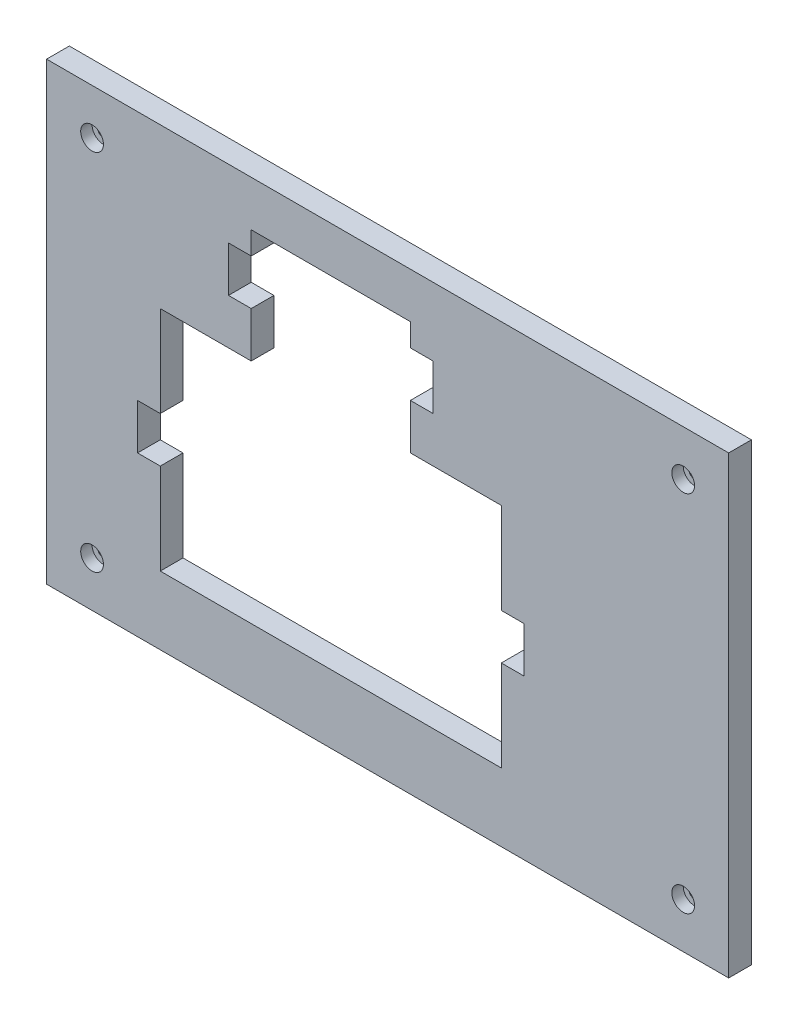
from build123d import *

# Parameters (mm, degrees)
ESQUISSE1_W                     = 300
ESQUISSE1_H                     = 200
EXTRUSION1_DEPTH                = 10
ENL_V_MAT_EXTRU_1_DEPTH         = 361.693775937
ESQUISSE4_R                     = 5
ENL_V_MAT_EXTRU_2_DEPTH         = 5
ESQUISSE5_R                     = 2.5
ENL_V_MAT_EXTRU_3_DEPTH         = 361.589794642
R_P_TITION_LIN_AIRE1_COUNT      = 2
R_P_TITION_LIN_AIRE1_PITCH      = 260
R_P_TITION_LIN_AIRE1_COUNT_DIR2 = 2
R_P_TITION_LIN_AIRE1_PITCH_DIR2 = 160


with BuildPart() as part:
    # Esquisse1 → Extrusion1 (new body)
    with BuildSketch(Plane.XY):
        with Locations((150, 100)):
            Rectangle(ESQUISSE1_W, ESQUISSE1_H)
    extrude(amount=-EXTRUSION1_DEPTH)

    # Esquisse2 → Enl_v. mat.-Extru.1 (cut, through all)
    with BuildSketch(Plane.XY):
        Polygon((50, 30), (200, 30), (200, 70), (210, 70), (210, 90), (200, 90), (200, 130), (160, 130), (160, 150), (170, 150), (170, 170), (160, 170), (160, 180), (90, 180), (90, 170), (80, 170), (80, 150), (90, 150), (90, 130), (50, 130), (50, 90), (40, 90), (40, 70), (50, 70), align=None)
    extrude(amount=-ENL_V_MAT_EXTRU_1_DEPTH, mode=Mode.SUBTRACT)

    # Esquisse4 → Enl_v. mat.-Extru.2 (cut)
    with BuildSketch(Plane.XY):
        with Locations((20, 180)):
            Circle(ESQUISSE4_R)
    enl_v_mat_extru_2 = extrude(amount=-ENL_V_MAT_EXTRU_2_DEPTH, mode=Mode.SUBTRACT)

    # Esquisse5 → Enl_v. mat.-Extru.3 (cut, through all)
    with BuildSketch(Plane.XY.offset(-5)):
        with Locations((20, 180)):
            Circle(ESQUISSE5_R)
    enl_v_mat_extru_3 = extrude(amount=-ENL_V_MAT_EXTRU_3_DEPTH, mode=Mode.SUBTRACT)

    # R_p_tition lin_aire1: Enl_v. mat.-Extru.2, Enl_v. mat.-Extru.3 2 × 2
    with Locations(*[(i * R_P_TITION_LIN_AIRE1_PITCH, -j * R_P_TITION_LIN_AIRE1_PITCH_DIR2, 0) for i in range(R_P_TITION_LIN_AIRE1_COUNT) for j in range(R_P_TITION_LIN_AIRE1_COUNT_DIR2) if (i, j) != (0, 0)]):
        add(enl_v_mat_extru_2, mode=Mode.SUBTRACT)
        add(enl_v_mat_extru_3, mode=Mode.SUBTRACT)


solid = part.part
